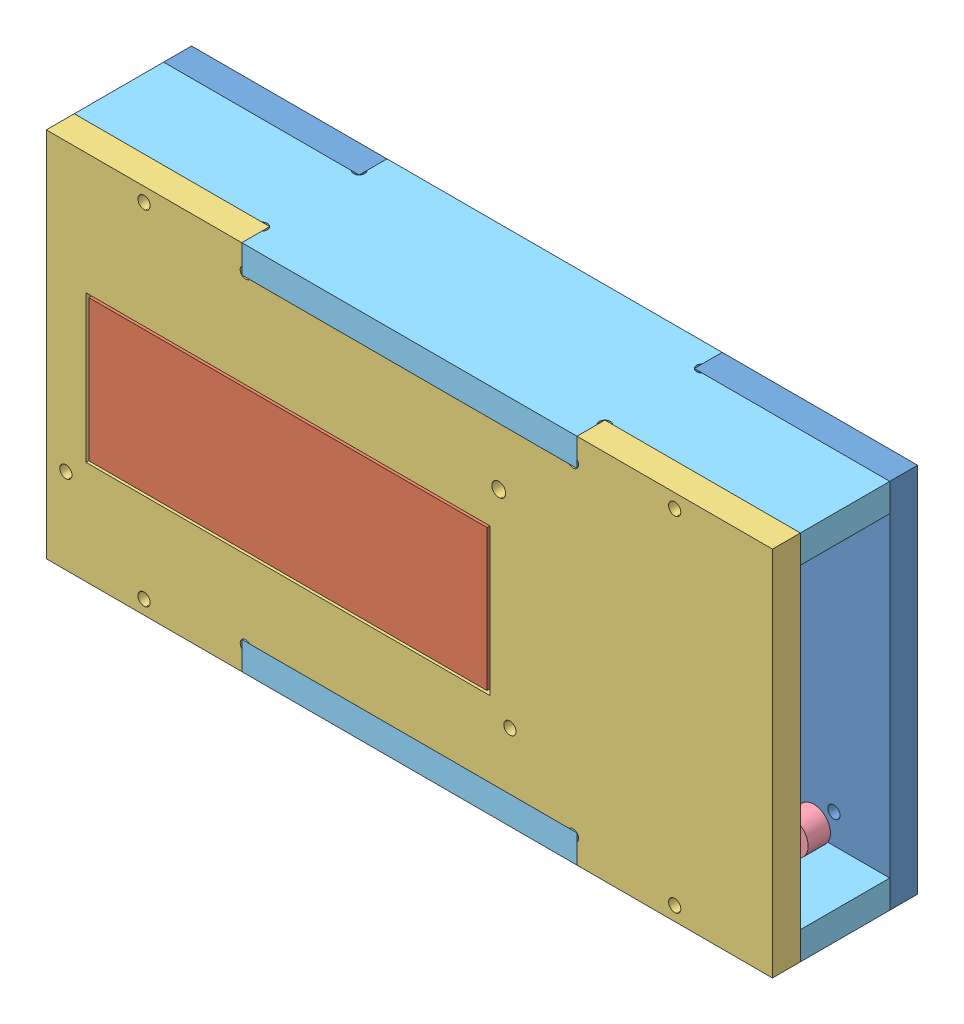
SolidWorks assembly assemblage socle OLED 2 lignes.SLDASM, configuration Défaut (file format 7000). Lengths in mm.
Overall size (130 66.5 26).
9 component instances, 5 part files, 17 mates.
Components (placement in the parent):
- support OLED 2 lignes-1: support OLED 2 lignes.SLDPRT [Défaut] at origin size (130 66.5 5)
- ecran OLED 2 lignes-1: ecran OLED 2 lignes.SLDPRT [Défaut] at (85.25 55.5 19.4) x (-1 0 0) z (0 0 1) size (84 44.5 19.1)
- cache OLED 2 lignes-1: cache OLED 2 lignes.SLDPRT [Défaut] at (0 0 21) size (130 66.5 5)
- entretoise D6x4-11: entretoise D6x4.SLDPRT [Défaut] at (120 10.25 8.6133) x (-0.048042 0.998845 0) z (0 0 1) size (6 6 4)
- entretoise D6x4-12: entretoise D6x4.SLDPRT [Défaut] at (98 10.25 7.0891) size (6 6 4)
- entretoise D6x4-13: entretoise D6x4.SLDPRT [Défaut] at (98 56.25 9.3022) x (-0.048042 0.998845 0) z (0 0 1) size (6 6 4)
- entretoise D6x4-14: entretoise D6x4.SLDPRT [Défaut] at (120 56.25 5) x (-0.891982 -0.45207 0) z (0 0 1) size (6 6 4)
- plaque-1: plaque.SLDPRT [Défaut] at (130 0 0) x (-1 0 0) z (0 1 0) size (130 26 5)
- plaque-2: plaque.SLDPRT [Défaut] at (130 61.5 0) x (-1 0 0) z (0 1 0) size (130 26 5)
Mates (geometry in assembly coordinates):
- Coaxiale82: concentric aligned: cylinder of ecran OLED 2 lignes-1 through (81 51.25 19.399) axis (0 0 1) radius 1.25; cylinder of cache OLED 2 lignes-1 through (81 51.25 20.999) axis (0 0 1) radius 1.25
- Parallèle1: parallel aligned: plane of ecran OLED 2 lignes-1 through (85.25 55.5 21) normal (0 1 0); plane of cache OLED 2 lignes-1 through (0 66.5 26) normal (0 1 0)
- Coïncidente20: coincident anti-aligned: plane of support OLED 2 lignes-1 through (0 66.5 5) normal (0 0 1); plane of entretoise D6x4-14 through (120 56.25 5) normal (0 0 -1)
- Coïncidente26: coincident anti-aligned: plane of support OLED 2 lignes-1 through (35 5 5.001) normal (0 -1 0); plane of plaque-1 through (130 5 26) normal (0 1 0)
- Coïncidente27: coincident anti-aligned: plane of support OLED 2 lignes-1 through (35 0 5.001) normal (1 0 0); plane of plaque-1 through (35 -0.001 0) normal (-1 0 0)
- Coïncidente28: coincident anti-aligned: plane of support OLED 2 lignes-1 through (0 66.5 5) normal (0 0 1); plane of plaque-1 through (0 -0.001 5) normal (0 0 -1)
- Coïncidente30: coincident anti-aligned: plane of cache OLED 2 lignes-1 through (95 5 20.999) normal (0 -1 0); plane of plaque-1 through (130 5 26) normal (0 1 0)
- Coïncidente31: coincident anti-aligned: plane of cache OLED 2 lignes-1 through (0 66.5 21) normal (0 0 -1); plane of plaque-1 through (0 -0.001 21) normal (0 0 1)
- Coïncidente32: coincident anti-aligned: plane of cache OLED 2 lignes-1 through (35 0 20.999) normal (1 0 0); plane of plaque-1 through (35 -0.001 26) normal (-1 0 0)
- Coïncidente33: coincident anti-aligned: plane of support OLED 2 lignes-1 through (35 61.5 5.001) normal (0 1 0); plane of plaque-2 through (130 61.5 26) normal (0 -1 0)
- Coïncidente34: coincident anti-aligned: plane of support OLED 2 lignes-1 through (95 66.5 5.001) normal (-1 0 0); plane of plaque-2 through (95 61.499 0) normal (1 0 0)
- Coïncidente35: coincident anti-aligned: plane of support OLED 2 lignes-1 through (0 66.5 5) normal (0 0 1); plane of plaque-2 through (130 61.499 5) normal (0 0 -1)
- Coïncidente36: coincident anti-aligned: plane of ecran OLED 2 lignes-1 through (85.25 11 21) normal (0 0 1); plane of cache OLED 2 lignes-1 through (0 66.5 21) normal (0 0 -1)
- Coïncidente37: coincident anti-aligned: axis of support OLED 2 lignes-1 through (120 10.25 0) axis (0 0 1); axis of entretoise D6x4-11 through (120 10.25 12.6133) axis (0 0 -1)
- Coïncidente38: coincident anti-aligned: axis of support OLED 2 lignes-1 through (120 56.25 0) axis (0 0 1); axis of entretoise D6x4-14 through (120 56.25 9) axis (0 0 -1)
- Coïncidente39: coincident anti-aligned: axis of support OLED 2 lignes-1 through (98 56.25 0) axis (0 0 1); axis of entretoise D6x4-13 through (98 56.25 13.3022) axis (0 0 -1)
- Coïncidente40: coincident anti-aligned: axis of support OLED 2 lignes-1 through (98 10.25 0) axis (0 0 1); axis of entretoise D6x4-12 through (98 10.25 11.0891) axis (0 0 -1)
